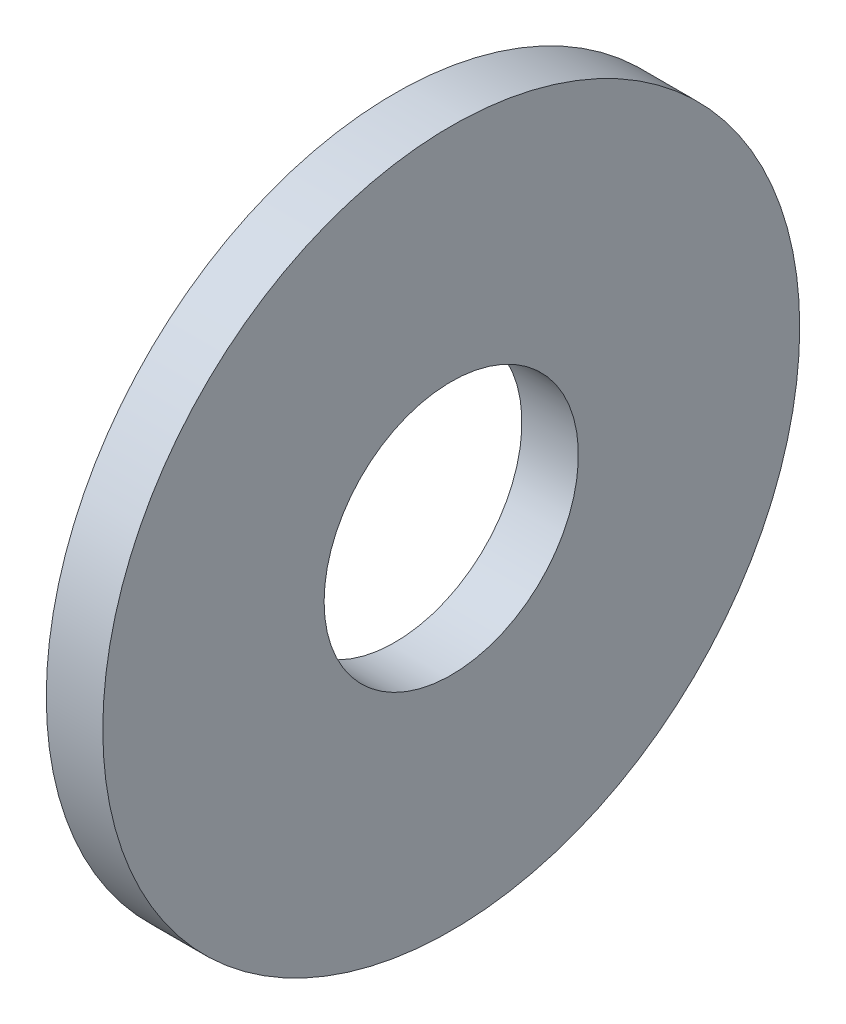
ISO-10303-21;
HEADER;
FILE_DESCRIPTION(('STEP AP214'),'2;1');
FILE_NAME('part.step','',(''),(''),'','','');
FILE_SCHEMA(('AUTOMOTIVE_DESIGN { 1 0 10303 214 1 1 1 1 }'));
ENDSEC;
DATA;
#1=APPLICATION_CONTEXT('core data for automotive mechanical design processes');
#2=APPLICATION_PROTOCOL_DEFINITION('international standard','automotive_design',2000,#1);
#3=PRODUCT_CONTEXT('',#1,'mechanical');
#4=PRODUCT('Part','Part','',(#3));
#5=PRODUCT_RELATED_PRODUCT_CATEGORY('part','',(#4));
#6=PRODUCT_DEFINITION_FORMATION('','',#4);
#7=PRODUCT_DEFINITION_CONTEXT('part definition',#1,'design');
#8=PRODUCT_DEFINITION('design','',#6,#7);
#9=PRODUCT_DEFINITION_SHAPE('','',#8);
#10=(LENGTH_UNIT() NAMED_UNIT(*) SI_UNIT(.MILLI.,.METRE.));
#11=(NAMED_UNIT(*) PLANE_ANGLE_UNIT() SI_UNIT($,.RADIAN.));
#12=(NAMED_UNIT(*) SI_UNIT($,.STERADIAN.) SOLID_ANGLE_UNIT());
#13=UNCERTAINTY_MEASURE_WITH_UNIT(LENGTH_MEASURE(1.E-05),#10,'distance_accuracy_value','');
#14=(GEOMETRIC_REPRESENTATION_CONTEXT(3) GLOBAL_UNCERTAINTY_ASSIGNED_CONTEXT((#13)) GLOBAL_UNIT_ASSIGNED_CONTEXT((#10,
#11,#12)) REPRESENTATION_CONTEXT('',''));
#15=CARTESIAN_POINT('',(0.,0.,0.));
#16=DIRECTION('',(0.,0.,1.));
#17=DIRECTION('',(1.,0.,0.));
#18=AXIS2_PLACEMENT_3D('',#15,#16,#17);
#19=CARTESIAN_POINT('',(-34.9249999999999,0.,0.));
#20=DIRECTION('',(-1.,0.,0.));
#21=DIRECTION('',(0.,0.,1.));
#22=AXIS2_PLACEMENT_3D('',#19,#20,#21);
#23=CYLINDRICAL_SURFACE('',#22,6.75);
#24=CARTESIAN_POINT('',(0.,0.,0.));
#25=DIRECTION('',(-1.,0.,0.));
#26=DIRECTION('',(0.,0.,1.));
#27=AXIS2_PLACEMENT_3D('',#24,#25,#26);
#28=CIRCLE('',#27,6.75);
#29=CARTESIAN_POINT('',(0.,0.,6.75));
#30=VERTEX_POINT('',#29);
#31=EDGE_CURVE('E48',#30,#30,#28,.T.);
#32=ORIENTED_EDGE('',*,*,#31,.F.);
#33=EDGE_LOOP('',(#32));
#34=FACE_BOUND('',#33,.T.);
#35=CARTESIAN_POINT('',(-3.,0.,0.));
#36=DIRECTION('',(-1.,0.,0.));
#37=DIRECTION('',(0.,0.,1.));
#38=AXIS2_PLACEMENT_3D('',#35,#36,#37);
#39=CIRCLE('',#38,6.75);
#40=CARTESIAN_POINT('',(-3.,0.,6.75));
#41=VERTEX_POINT('',#40);
#42=EDGE_CURVE('E10',#41,#41,#39,.T.);
#43=ORIENTED_EDGE('',*,*,#42,.T.);
#44=EDGE_LOOP('',(#43));
#45=FACE_BOUND('',#44,.T.);
#46=ADVANCED_FACE('F34',(#34,#45),#23,.F.);
#47=CARTESIAN_POINT('',(-3.,18.5,0.));
#48=DIRECTION('',(1.,0.,0.));
#49=DIRECTION('',(0.,0.,-1.));
#50=AXIS2_PLACEMENT_3D('',#47,#48,#49);
#51=PLANE('',#50);
#52=ORIENTED_EDGE('',*,*,#42,.F.);
#53=EDGE_LOOP('',(#52));
#54=FACE_BOUND('',#53,.T.);
#55=CARTESIAN_POINT('',(-3.,0.,0.));
#56=DIRECTION('',(-1.,0.,0.));
#57=DIRECTION('',(0.,0.,1.));
#58=AXIS2_PLACEMENT_3D('',#55,#56,#57);
#59=CIRCLE('',#58,18.5);
#60=CARTESIAN_POINT('',(-3.,0.,18.5));
#61=VERTEX_POINT('',#60);
#62=EDGE_CURVE('E40',#61,#61,#59,.T.);
#63=ORIENTED_EDGE('',*,*,#62,.T.);
#64=EDGE_LOOP('',(#63));
#65=FACE_BOUND('',#64,.T.);
#66=ADVANCED_FACE('F57',(#54,#65),#51,.F.);
#67=CARTESIAN_POINT('',(-34.9249999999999,0.,0.));
#68=DIRECTION('',(-1.,0.,0.));
#69=DIRECTION('',(0.,0.,1.));
#70=AXIS2_PLACEMENT_3D('',#67,#68,#69);
#71=CYLINDRICAL_SURFACE('',#70,18.5);
#72=ORIENTED_EDGE('',*,*,#62,.F.);
#73=EDGE_LOOP('',(#72));
#74=FACE_BOUND('',#73,.T.);
#75=CARTESIAN_POINT('',(0.,0.,0.));
#76=DIRECTION('',(-1.,0.,0.));
#77=DIRECTION('',(0.,0.,1.));
#78=AXIS2_PLACEMENT_3D('',#75,#76,#77);
#79=CIRCLE('',#78,18.5);
#80=CARTESIAN_POINT('',(0.,0.,18.5));
#81=VERTEX_POINT('',#80);
#82=EDGE_CURVE('E44',#81,#81,#79,.T.);
#83=ORIENTED_EDGE('',*,*,#82,.T.);
#84=EDGE_LOOP('',(#83));
#85=FACE_BOUND('',#84,.T.);
#86=ADVANCED_FACE('F61',(#74,#85),#71,.T.);
#87=CARTESIAN_POINT('',(0.,6.75,0.));
#88=DIRECTION('',(-1.,0.,0.));
#89=DIRECTION('',(0.,0.,1.));
#90=AXIS2_PLACEMENT_3D('',#87,#88,#89);
#91=PLANE('',#90);
#92=ORIENTED_EDGE('',*,*,#82,.F.);
#93=EDGE_LOOP('',(#92));
#94=FACE_BOUND('',#93,.T.);
#95=ORIENTED_EDGE('',*,*,#31,.T.);
#96=EDGE_LOOP('',(#95));
#97=FACE_BOUND('',#96,.T.);
#98=ADVANCED_FACE('F54',(#94,#97),#91,.F.);
#99=CLOSED_SHELL('',(#46,#66,#86,#98));
#100=MANIFOLD_SOLID_BREP('B2',#99);
#101=ADVANCED_BREP_SHAPE_REPRESENTATION('',(#18,#100),#14);
#102=SHAPE_DEFINITION_REPRESENTATION(#9,#101);
ENDSEC;
END-ISO-10303-21;
